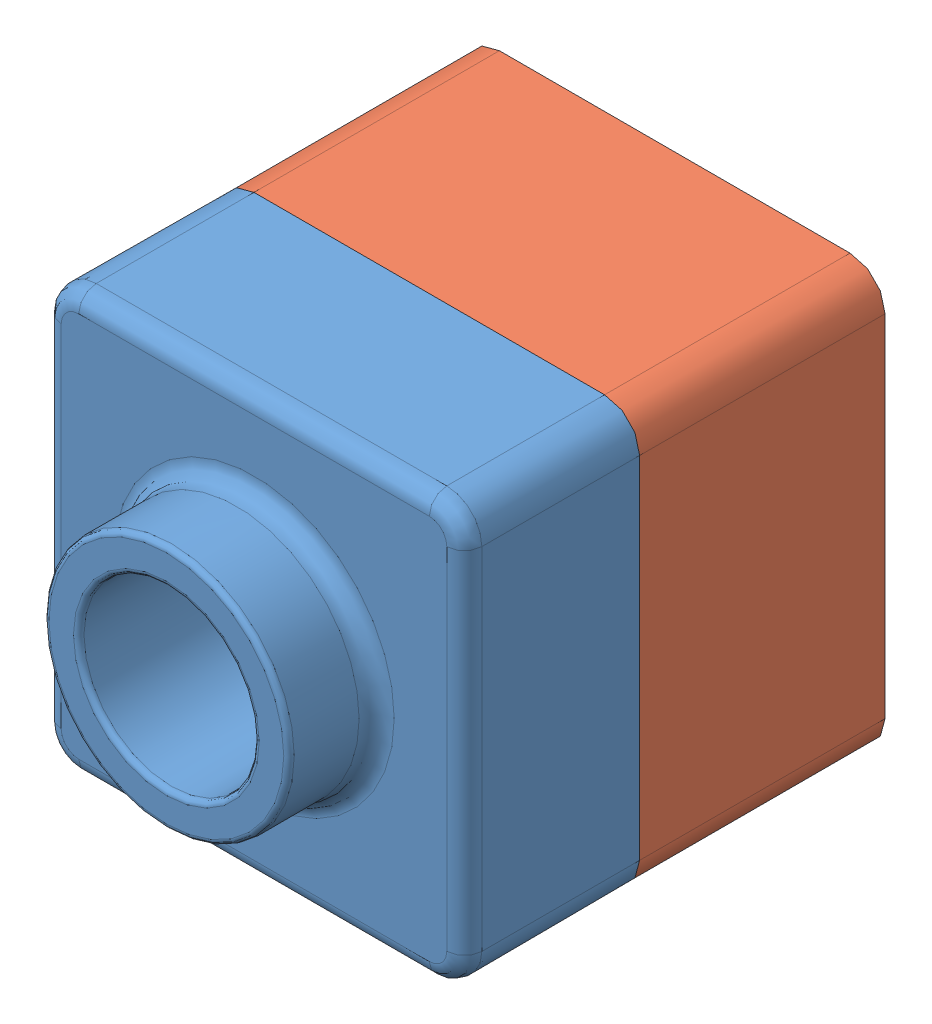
SolidWorks assembly tutor assembly.SLDASM, configuration Default (file format 4400). Lengths in mm.
Overall size (120 120 145).
2 component instances, 2 part files, 3 mates.
Components (placement in the parent):
- tutor1-1: tutor1.SLDPRT [Default] at (-67.8155 -69.1333 -27.1708) size (120 120 75)
- Tutor2-1: Tutor2.SLDPRT [Default] at (-67.8155 -69.1333 -97.1708) size (120 120 90)
Mates (geometry in assembly coordinates):
- Coincident1: coincident aligned: line of tutor1-1 through (42.1845 50.8667 -27.1708) axis (-1 0 0); line of Tutor2-1 through (42.1845 50.8667 -27.1708) axis (-1 0 0)
- Coincident10: coincident aligned: plane of tutor1-1 through (52.1845 -69.1333 22.8292) normal (1 0 0); plane of Tutor2-1 through (52.1845 -69.1333 -7.1708) normal (1 0 0)
- Coincident11: coincident aligned: plane of tutor1-1 through (-67.8155 50.8667 22.8292) normal (0 1 0); plane of Tutor2-1 through (-67.8155 50.8667 -7.1708) normal (0 1 0)
